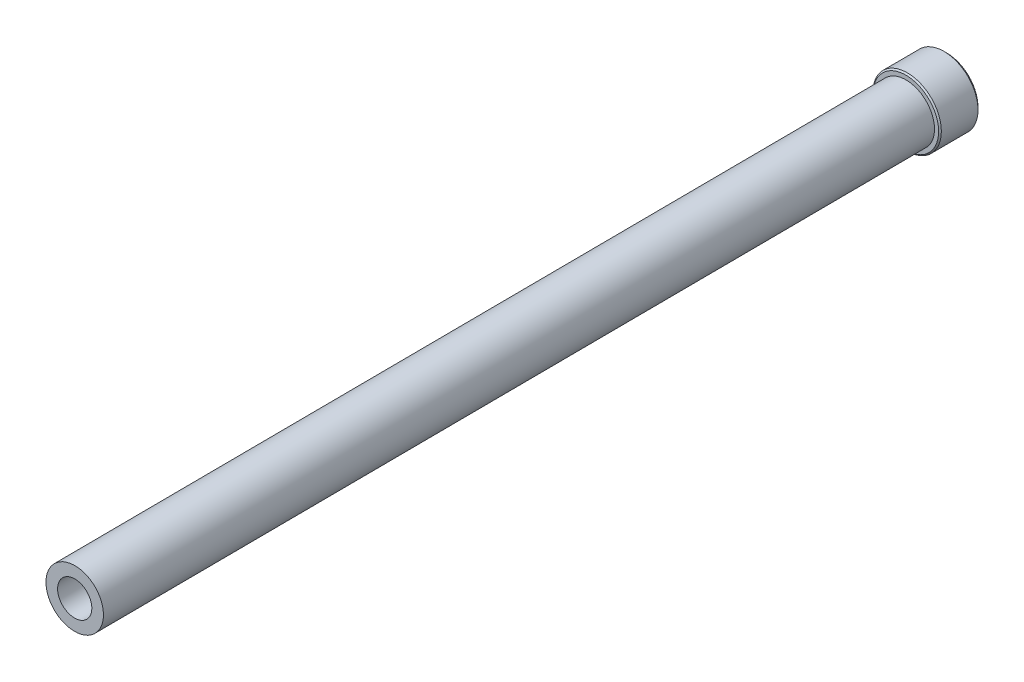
ISO-10303-21;
HEADER;
FILE_DESCRIPTION(('STEP AP214'),'2;1');
FILE_NAME('part.step','',(''),(''),'','','');
FILE_SCHEMA(('AUTOMOTIVE_DESIGN { 1 0 10303 214 1 1 1 1 }'));
ENDSEC;
DATA;
#1=APPLICATION_CONTEXT('core data for automotive mechanical design processes');
#2=APPLICATION_PROTOCOL_DEFINITION('international standard','automotive_design',2000,#1);
#3=PRODUCT_CONTEXT('',#1,'mechanical');
#4=PRODUCT('Part','Part','',(#3));
#5=PRODUCT_RELATED_PRODUCT_CATEGORY('part','',(#4));
#6=PRODUCT_DEFINITION_FORMATION('','',#4);
#7=PRODUCT_DEFINITION_CONTEXT('part definition',#1,'design');
#8=PRODUCT_DEFINITION('design','',#6,#7);
#9=PRODUCT_DEFINITION_SHAPE('','',#8);
#10=(LENGTH_UNIT() NAMED_UNIT(*) SI_UNIT(.MILLI.,.METRE.));
#11=(NAMED_UNIT(*) PLANE_ANGLE_UNIT() SI_UNIT($,.RADIAN.));
#12=(NAMED_UNIT(*) SI_UNIT($,.STERADIAN.) SOLID_ANGLE_UNIT());
#13=UNCERTAINTY_MEASURE_WITH_UNIT(LENGTH_MEASURE(1.E-05),#10,'distance_accuracy_value','');
#14=(GEOMETRIC_REPRESENTATION_CONTEXT(3) GLOBAL_UNCERTAINTY_ASSIGNED_CONTEXT((#13)) GLOBAL_UNIT_ASSIGNED_CONTEXT((#10,
#11,#12)) REPRESENTATION_CONTEXT('',''));
#15=CARTESIAN_POINT('',(0.,0.,0.));
#16=DIRECTION('',(0.,0.,1.));
#17=DIRECTION('',(1.,0.,0.));
#18=AXIS2_PLACEMENT_3D('',#15,#16,#17);
#19=CARTESIAN_POINT('',(-79.5731466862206,7.84095011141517E-13,-888.998834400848));
#20=DIRECTION('',(-0.00617464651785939,0.,-0.999980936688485));
#21=DIRECTION('',(-0.974076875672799,0.226137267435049,0.00601469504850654));
#22=AXIS2_PLACEMENT_3D('',#19,#20,#21);
#23=CONICAL_SURFACE('',#22,24.,0.785398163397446);
#24=CARTESIAN_POINT('',(-79.5793213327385,8.04911692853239E-13,-889.998815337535));
#25=DIRECTION('',(0.00617464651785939,0.,0.999980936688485));
#26=DIRECTION('',(0.974076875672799,-0.226137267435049,-0.00601469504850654));
#27=AXIS2_PLACEMENT_3D('',#24,#25,#26);
#28=CIRCLE('',#27,25.);
#29=CARTESIAN_POINT('',(-55.2273994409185,-5.65343168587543,-890.149182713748));
#30=VERTEX_POINT('',#29);
#31=EDGE_CURVE('E41',#30,#30,#28,.F.);
#32=ORIENTED_EDGE('',*,*,#31,.F.);
#33=EDGE_LOOP('',(#32));
#34=FACE_BOUND('',#33,.T.);
#35=CARTESIAN_POINT('',(-79.5731466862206,7.84095011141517E-13,-888.998834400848));
#36=DIRECTION('',(0.00617464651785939,0.,0.999980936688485));
#37=DIRECTION('',(0.974076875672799,-0.226137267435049,-0.00601469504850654));
#38=AXIS2_PLACEMENT_3D('',#35,#36,#37);
#39=CIRCLE('',#38,24.);
#40=CARTESIAN_POINT('',(-56.1953016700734,-5.4272944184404,-889.143187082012));
#41=VERTEX_POINT('',#40);
#42=EDGE_CURVE('E34',#41,#41,#39,.T.);
#43=ORIENTED_EDGE('',*,*,#42,.F.);
#44=EDGE_LOOP('',(#43));
#45=FACE_BOUND('',#44,.T.);
#46=ADVANCED_FACE('F14',(#34,#45),#23,.T.);
#47=CARTESIAN_POINT('',(-79.5731466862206,7.84095011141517E-13,-888.998834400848));
#48=DIRECTION('',(0.00617464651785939,0.,0.999980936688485));
#49=DIRECTION('',(0.974076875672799,-0.226137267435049,-0.00601469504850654));
#50=AXIS2_PLACEMENT_3D('',#47,#48,#49);
#51=PLANE('',#50);
#52=ORIENTED_EDGE('',*,*,#42,.T.);
#53=EDGE_LOOP('',(#52));
#54=FACE_BOUND('',#53,.T.);
#55=CARTESIAN_POINT('',(-79.5731466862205,7.59808882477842E-13,-888.998834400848));
#56=DIRECTION('',(0.00617464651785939,0.,0.999980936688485));
#57=DIRECTION('',(0.974076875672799,-0.226137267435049,-0.00601469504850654));
#58=AXIS2_PLACEMENT_3D('',#55,#56,#57);
#59=CIRCLE('',#58,21.);
#60=CARTESIAN_POINT('',(-59.1175322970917,-4.74888261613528,-889.125142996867));
#61=VERTEX_POINT('',#60);
#62=EDGE_CURVE('E9',#61,#61,#59,.F.);
#63=ORIENTED_EDGE('',*,*,#62,.T.);
#64=EDGE_LOOP('',(#63));
#65=FACE_BOUND('',#64,.T.);
#66=ADVANCED_FACE('F72',(#54,#65),#51,.T.);
#67=CARTESIAN_POINT('',(-79.7583860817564,9.0205620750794E-13,-918.998262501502));
#68=DIRECTION('',(0.00617464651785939,0.,0.999980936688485));
#69=DIRECTION('',(0.974076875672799,-0.226137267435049,-0.00601469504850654));
#70=AXIS2_PLACEMENT_3D('',#67,#68,#69);
#71=CYLINDRICAL_SURFACE('',#70,25.);
#72=CARTESIAN_POINT('',(-79.746839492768,8.81239525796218E-13,-917.128298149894));
#73=DIRECTION('',(-0.00617464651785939,0.,-0.999980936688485));
#74=DIRECTION('',(-0.974076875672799,0.226137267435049,0.00601469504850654));
#75=AXIS2_PLACEMENT_3D('',#72,#73,#74);
#76=CIRCLE('',#75,25.);
#77=CARTESIAN_POINT('',(-104.098761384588,5.65343168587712,-916.977930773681));
#78=VERTEX_POINT('',#77);
#79=EDGE_CURVE('E18',#78,#78,#76,.F.);
#80=ORIENTED_EDGE('',*,*,#79,.T.);
#81=EDGE_LOOP('',(#80));
#82=FACE_BOUND('',#81,.T.);
#83=ORIENTED_EDGE('',*,*,#31,.T.);
#84=EDGE_LOOP('',(#83));
#85=FACE_BOUND('',#84,.T.);
#86=ADVANCED_FACE('F79',(#82,#85),#71,.T.);
#87=CARTESIAN_POINT('',(-79.7591887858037,8.95117313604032E-13,-919.128260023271));
#88=DIRECTION('',(-0.00617464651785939,0.,-0.999980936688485));
#89=DIRECTION('',(-0.974076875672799,0.226137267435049,0.00601469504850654));
#90=AXIS2_PLACEMENT_3D('',#87,#88,#89);
#91=PLANE('',#90);
#92=CARTESIAN_POINT('',(-79.7591887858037,8.95117313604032E-13,-919.128260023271));
#93=DIRECTION('',(-0.00617464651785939,0.,-0.999980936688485));
#94=DIRECTION('',(-0.974076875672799,0.226137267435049,0.00601469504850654));
#95=AXIS2_PLACEMENT_3D('',#92,#93,#94);
#96=CIRCLE('',#95,23.);
#97=CARTESIAN_POINT('',(-102.162956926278,5.20115715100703,-918.989922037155));
#98=VERTEX_POINT('',#97);
#99=EDGE_CURVE('E26',#98,#98,#96,.T.);
#100=ORIENTED_EDGE('',*,*,#99,.T.);
#101=EDGE_LOOP('',(#100));
#102=FACE_BOUND('',#101,.T.);
#103=CARTESIAN_POINT('',(-79.7591887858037,8.95117313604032E-13,-919.128260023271));
#104=DIRECTION('',(-0.00617464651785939,0.,-0.999980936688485));
#105=DIRECTION('',(-0.974076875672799,0.226137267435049,0.00601469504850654));
#106=AXIS2_PLACEMENT_3D('',#103,#104,#105);
#107=CIRCLE('',#106,7.5);
#108=CARTESIAN_POINT('',(-87.0647653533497,1.69602950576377,-919.083149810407));
#109=VERTEX_POINT('',#108);
#110=EDGE_CURVE('E31',#109,#109,#107,.T.);
#111=ORIENTED_EDGE('',*,*,#110,.F.);
#112=EDGE_LOOP('',(#111));
#113=FACE_BOUND('',#112,.T.);
#114=ADVANCED_FACE('F51',(#102,#113),#91,.T.);
#115=CARTESIAN_POINT('',(-79.5731466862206,7.84095011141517E-13,-888.998834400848));
#116=DIRECTION('',(0.00617464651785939,0.,0.999980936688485));
#117=DIRECTION('',(0.974076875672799,-0.226137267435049,-0.00601469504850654));
#118=AXIS2_PLACEMENT_3D('',#115,#116,#117);
#119=CYLINDRICAL_SURFACE('',#118,7.5);
#120=ORIENTED_EDGE('',*,*,#110,.T.);
#121=EDGE_LOOP('',(#120));
#122=FACE_BOUND('',#121,.T.);
#123=CARTESIAN_POINT('',(-79.7808000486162,9.0205620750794E-13,-922.628193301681));
#124=DIRECTION('',(-0.00617464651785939,0.,-0.999980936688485));
#125=DIRECTION('',(-0.974076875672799,0.226137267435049,0.00601469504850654));
#126=AXIS2_PLACEMENT_3D('',#123,#124,#125);
#127=CIRCLE('',#126,7.5);
#128=CARTESIAN_POINT('',(-87.0863766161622,1.69602950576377,-922.583083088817));
#129=VERTEX_POINT('',#128);
#130=EDGE_CURVE('E28',#129,#129,#127,.T.);
#131=ORIENTED_EDGE('',*,*,#130,.F.);
#132=EDGE_LOOP('',(#131));
#133=FACE_BOUND('',#132,.T.);
#134=ADVANCED_FACE('F67',(#122,#133),#119,.T.);
#135=CARTESIAN_POINT('',(-79.7808000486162,9.0205620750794E-13,-922.628193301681));
#136=DIRECTION('',(-0.00617464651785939,0.,-0.999980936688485));
#137=DIRECTION('',(-0.974076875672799,0.226137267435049,0.00601469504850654));
#138=AXIS2_PLACEMENT_3D('',#135,#136,#137);
#139=PLANE('',#138);
#140=ORIENTED_EDGE('',*,*,#130,.T.);
#141=EDGE_LOOP('',(#140));
#142=FACE_BOUND('',#141,.T.);
#143=ADVANCED_FACE('F56',(#142),#139,.T.);
#144=CARTESIAN_POINT('',(-79.7591887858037,8.95117313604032E-13,-919.128260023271));
#145=DIRECTION('',(0.00617464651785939,0.,0.999980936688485));
#146=DIRECTION('',(0.974076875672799,-0.226137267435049,-0.00601469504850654));
#147=AXIS2_PLACEMENT_3D('',#144,#145,#146);
#148=CONICAL_SURFACE('',#147,23.,0.785398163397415);
#149=ORIENTED_EDGE('',*,*,#79,.F.);
#150=EDGE_LOOP('',(#149));
#151=FACE_BOUND('',#150,.T.);
#152=ORIENTED_EDGE('',*,*,#99,.F.);
#153=EDGE_LOOP('',(#152));
#154=FACE_BOUND('',#153,.T.);
#155=ADVANCED_FACE('F16',(#151,#154),#148,.T.);
#156=CARTESIAN_POINT('',(-79.6966396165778,8.56953397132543E-13,-908.998453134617));
#157=DIRECTION('',(-0.00617464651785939,0.,-0.999980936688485));
#158=DIRECTION('',(-0.974076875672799,0.226137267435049,0.00601469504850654));
#159=AXIS2_PLACEMENT_3D('',#156,#157,#158);
#160=PLANE('',#159);
#161=CARTESIAN_POINT('',(-79.6966396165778,8.56953397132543E-13,-908.998453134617));
#162=DIRECTION('',(-0.00617464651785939,0.,-0.999980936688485));
#163=DIRECTION('',(-0.974076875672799,0.226137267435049,0.00601469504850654));
#164=AXIS2_PLACEMENT_3D('',#161,#162,#163);
#165=CIRCLE('',#164,12.5);
#166=CARTESIAN_POINT('',(-91.8726005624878,2.82671584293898,-908.923269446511));
#167=VERTEX_POINT('',#166);
#168=EDGE_CURVE('E35',#167,#167,#165,.F.);
#169=ORIENTED_EDGE('',*,*,#168,.T.);
#170=EDGE_LOOP('',(#169));
#171=FACE_BOUND('',#170,.T.);
#172=ADVANCED_FACE('F55',(#171),#160,.F.);
#173=CARTESIAN_POINT('',(-76.1462178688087,-1.07899800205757E-12,-334.009414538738));
#174=DIRECTION('',(0.00617464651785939,0.,0.999980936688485));
#175=DIRECTION('',(0.226132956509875,0.974095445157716,-0.00139631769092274));
#176=AXIS2_PLACEMENT_3D('',#173,#174,#175);
#177=CYLINDRICAL_SURFACE('',#176,12.5);
#178=CARTESIAN_POINT('',(-75.7757390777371,-1.29063426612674E-12,-274.010558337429));
#179=DIRECTION('',(-0.00617464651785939,0.,-0.999980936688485));
#180=DIRECTION('',(-0.974076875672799,0.226137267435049,0.00601469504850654));
#181=AXIS2_PLACEMENT_3D('',#178,#179,#180);
#182=CIRCLE('',#181,12.5);
#183=CARTESIAN_POINT('',(-87.9517000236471,2.82671584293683,-273.935374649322));
#184=VERTEX_POINT('',#183);
#185=EDGE_CURVE('E38',#184,#184,#182,.T.);
#186=ORIENTED_EDGE('',*,*,#185,.F.);
#187=EDGE_LOOP('',(#186));
#188=FACE_BOUND('',#187,.T.);
#189=ORIENTED_EDGE('',*,*,#168,.F.);
#190=EDGE_LOOP('',(#189));
#191=FACE_BOUND('',#190,.T.);
#192=ADVANCED_FACE('F64',(#188,#191),#177,.F.);
#193=CARTESIAN_POINT('',(-71.7053458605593,17.5337180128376,-274.035692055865));
#194=DIRECTION('',(0.00617464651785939,0.,0.999980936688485));
#195=DIRECTION('',(0.974076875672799,-0.226137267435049,-0.00601469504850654));
#196=AXIS2_PLACEMENT_3D('',#193,#194,#195);
#197=PLANE('',#196);
#198=CARTESIAN_POINT('',(-75.7757390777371,-1.29063426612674E-12,-274.010558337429));
#199=DIRECTION('',(0.00617464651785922,0.,0.999980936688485));
#200=DIRECTION('',(0.974076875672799,-0.226137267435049,-0.00601469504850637));
#201=AXIS2_PLACEMENT_3D('',#198,#199,#200);
#202=CIRCLE('',#201,21.);
#203=CARTESIAN_POINT('',(-55.3201246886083,-4.74888261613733,-274.136866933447));
#204=VERTEX_POINT('',#203);
#205=EDGE_CURVE('E44',#204,#204,#202,.T.);
#206=ORIENTED_EDGE('',*,*,#205,.T.);
#207=EDGE_LOOP('',(#206));
#208=FACE_BOUND('',#207,.T.);
#209=ORIENTED_EDGE('',*,*,#185,.T.);
#210=EDGE_LOOP('',(#209));
#211=FACE_BOUND('',#210,.T.);
#212=ADVANCED_FACE('F89',(#208,#211),#197,.T.);
#213=CARTESIAN_POINT('',(-80.069569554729,1.03389519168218E-12,-969.39427138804));
#214=DIRECTION('',(0.00617464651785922,0.,0.999980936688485));
#215=DIRECTION('',(0.974076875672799,-0.226137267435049,-0.00601469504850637));
#216=AXIS2_PLACEMENT_3D('',#213,#214,#215);
#217=CYLINDRICAL_SURFACE('',#216,21.);
#218=ORIENTED_EDGE('',*,*,#62,.F.);
#219=EDGE_LOOP('',(#218));
#220=FACE_BOUND('',#219,.T.);
#221=ORIENTED_EDGE('',*,*,#205,.F.);
#222=EDGE_LOOP('',(#221));
#223=FACE_BOUND('',#222,.T.);
#224=ADVANCED_FACE('F86',(#220,#223),#217,.T.);
#225=CLOSED_SHELL('',(#46,#66,#86,#114,#134,#143,#155,#172,#192,#212,#224));
#226=MANIFOLD_SOLID_BREP('B1',#225);
#227=ADVANCED_BREP_SHAPE_REPRESENTATION('',(#18,#226),#14);
#228=SHAPE_DEFINITION_REPRESENTATION(#9,#227);
ENDSEC;
END-ISO-10303-21;
